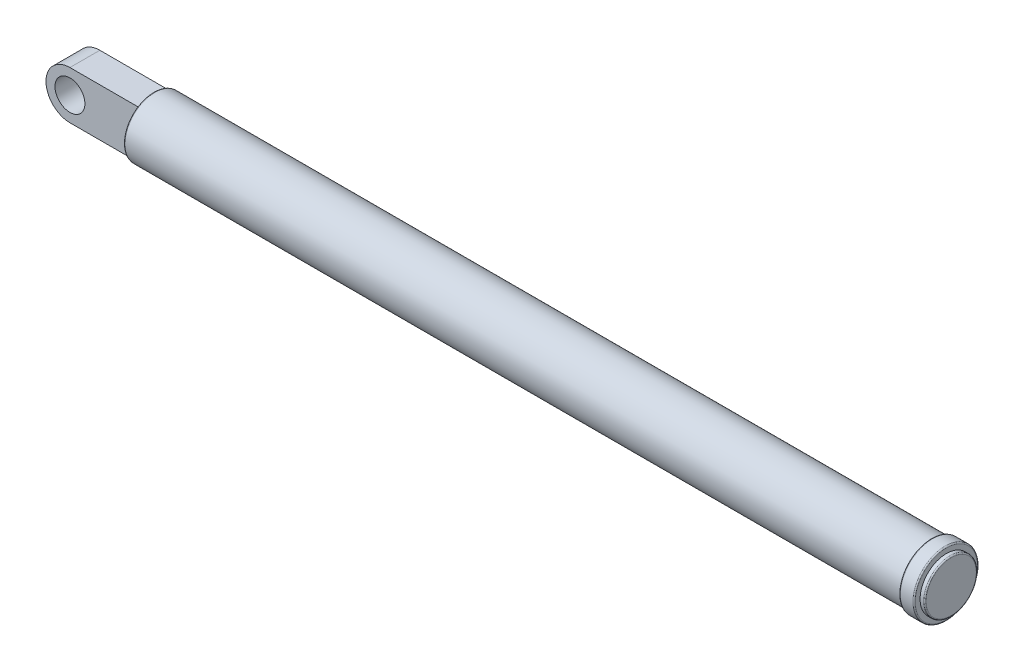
ISO-10303-21;
HEADER;
FILE_DESCRIPTION(('STEP AP214'),'2;1');
FILE_NAME('part.step','',(''),(''),'','','');
FILE_SCHEMA(('AUTOMOTIVE_DESIGN { 1 0 10303 214 1 1 1 1 }'));
ENDSEC;
DATA;
#1=APPLICATION_CONTEXT('core data for automotive mechanical design processes');
#2=APPLICATION_PROTOCOL_DEFINITION('international standard','automotive_design',2000,#1);
#3=PRODUCT_CONTEXT('',#1,'mechanical');
#4=PRODUCT('Part','Part','',(#3));
#5=PRODUCT_RELATED_PRODUCT_CATEGORY('part','',(#4));
#6=PRODUCT_DEFINITION_FORMATION('','',#4);
#7=PRODUCT_DEFINITION_CONTEXT('part definition',#1,'design');
#8=PRODUCT_DEFINITION('design','',#6,#7);
#9=PRODUCT_DEFINITION_SHAPE('','',#8);
#10=(LENGTH_UNIT() NAMED_UNIT(*) SI_UNIT(.MILLI.,.METRE.));
#11=(NAMED_UNIT(*) PLANE_ANGLE_UNIT() SI_UNIT($,.RADIAN.));
#12=(NAMED_UNIT(*) SI_UNIT($,.STERADIAN.) SOLID_ANGLE_UNIT());
#13=UNCERTAINTY_MEASURE_WITH_UNIT(LENGTH_MEASURE(1.E-05),#10,'distance_accuracy_value','');
#14=(GEOMETRIC_REPRESENTATION_CONTEXT(3) GLOBAL_UNCERTAINTY_ASSIGNED_CONTEXT((#13)) GLOBAL_UNIT_ASSIGNED_CONTEXT((#10,
#11,#12)) REPRESENTATION_CONTEXT('',''));
#15=CARTESIAN_POINT('',(0.,0.,0.));
#16=DIRECTION('',(0.,0.,1.));
#17=DIRECTION('',(1.,0.,0.));
#18=AXIS2_PLACEMENT_3D('',#15,#16,#17);
#19=CARTESIAN_POINT('',(0.,0.,0.));
#20=DIRECTION('',(1.,0.,0.));
#21=DIRECTION('',(0.,0.,-1.));
#22=AXIS2_PLACEMENT_3D('',#19,#20,#21);
#23=PLANE('',#22);
#24=CARTESIAN_POINT('',(0.,0.,0.));
#25=DIRECTION('',(1.,0.,0.));
#26=DIRECTION('',(0.,0.,-1.));
#27=AXIS2_PLACEMENT_3D('',#24,#25,#26);
#28=CIRCLE('',#27,48.);
#29=CARTESIAN_POINT('',(0.,0.,-48.));
#30=VERTEX_POINT('',#29);
#31=EDGE_CURVE('E103',#30,#30,#28,.F.);
#32=ORIENTED_EDGE('',*,*,#31,.T.);
#33=EDGE_LOOP('',(#32));
#34=FACE_BOUND('',#33,.T.);
#35=DIRECTION('',(0.,0.,1.));
#36=VECTOR('',#35,1.);
#37=CARTESIAN_POINT('',(0.,-40.,0.));
#38=LINE('',#37,#36);
#39=CARTESIAN_POINT('',(0.,-40.,-25.));
#40=VERTEX_POINT('',#39);
#41=CARTESIAN_POINT('',(0.,-40.,25.));
#42=VERTEX_POINT('',#41);
#43=EDGE_CURVE('E11',#40,#42,#38,.T.);
#44=ORIENTED_EDGE('',*,*,#43,.F.);
#45=DIRECTION('',(0.,-1.,0.));
#46=VECTOR('',#45,1.);
#47=CARTESIAN_POINT('',(0.,0.,-25.));
#48=LINE('',#47,#46);
#49=CARTESIAN_POINT('',(0.,40.,-25.));
#50=VERTEX_POINT('',#49);
#51=EDGE_CURVE('E127',#50,#40,#48,.T.);
#52=ORIENTED_EDGE('',*,*,#51,.F.);
#53=DIRECTION('',(0.,0.,-1.));
#54=VECTOR('',#53,1.);
#55=CARTESIAN_POINT('',(0.,40.,0.));
#56=LINE('',#55,#54);
#57=CARTESIAN_POINT('',(0.,40.,25.));
#58=VERTEX_POINT('',#57);
#59=EDGE_CURVE('E124',#58,#50,#56,.T.);
#60=ORIENTED_EDGE('',*,*,#59,.F.);
#61=DIRECTION('',(0.,-1.,0.));
#62=VECTOR('',#61,1.);
#63=CARTESIAN_POINT('',(0.,0.,25.));
#64=LINE('',#63,#62);
#65=EDGE_CURVE('E39',#58,#42,#64,.T.);
#66=ORIENTED_EDGE('',*,*,#65,.T.);
#67=EDGE_LOOP('',(#44,#52,#60,#66));
#68=FACE_BOUND('',#67,.T.);
#69=ADVANCED_FACE('F31',(#34,#68),#23,.F.);
#70=CARTESIAN_POINT('',(1325.,0.,0.));
#71=DIRECTION('',(1.,0.,0.));
#72=DIRECTION('',(0.,0.,-1.));
#73=AXIS2_PLACEMENT_3D('',#70,#71,#72);
#74=PLANE('',#73);
#75=CARTESIAN_POINT('',(1325.,0.,0.));
#76=DIRECTION('',(1.,0.,0.));
#77=DIRECTION('',(0.,0.,-1.));
#78=AXIS2_PLACEMENT_3D('',#75,#76,#77);
#79=CIRCLE('',#78,52.);
#80=CARTESIAN_POINT('',(1325.,0.,-52.));
#81=VERTEX_POINT('',#80);
#82=EDGE_CURVE('E112',#81,#81,#79,.T.);
#83=ORIENTED_EDGE('',*,*,#82,.T.);
#84=EDGE_LOOP('',(#83));
#85=FACE_BOUND('',#84,.T.);
#86=CARTESIAN_POINT('',(1325.,0.,0.));
#87=DIRECTION('',(1.,0.,0.));
#88=DIRECTION('',(0.,0.,-1.));
#89=AXIS2_PLACEMENT_3D('',#86,#87,#88);
#90=CIRCLE('',#89,44.);
#91=CARTESIAN_POINT('',(1325.,0.,-44.));
#92=VERTEX_POINT('',#91);
#93=EDGE_CURVE('E89',#92,#92,#90,.T.);
#94=ORIENTED_EDGE('',*,*,#93,.F.);
#95=EDGE_LOOP('',(#94));
#96=FACE_BOUND('',#95,.T.);
#97=ADVANCED_FACE('F158',(#85,#96),#74,.T.);
#98=CARTESIAN_POINT('',(1300.,0.,0.));
#99=DIRECTION('',(-1.,0.,0.));
#100=DIRECTION('',(0.,0.,1.));
#101=AXIS2_PLACEMENT_3D('',#98,#99,#100);
#102=CYLINDRICAL_SURFACE('',#101,50.);
#103=CARTESIAN_POINT('',(2.,0.,0.));
#104=DIRECTION('',(1.,0.,0.));
#105=DIRECTION('',(0.,0.,-1.));
#106=AXIS2_PLACEMENT_3D('',#103,#104,#105);
#107=CIRCLE('',#106,50.);
#108=CARTESIAN_POINT('',(2.,0.,-50.));
#109=VERTEX_POINT('',#108);
#110=EDGE_CURVE('E100',#109,#109,#107,.T.);
#111=ORIENTED_EDGE('',*,*,#110,.T.);
#112=EDGE_LOOP('',(#111));
#113=FACE_BOUND('',#112,.T.);
#114=CARTESIAN_POINT('',(1300.,0.,0.));
#115=DIRECTION('',(1.,0.,0.));
#116=DIRECTION('',(0.,0.,-1.));
#117=AXIS2_PLACEMENT_3D('',#114,#115,#116);
#118=CIRCLE('',#117,50.);
#119=CARTESIAN_POINT('',(1300.,0.,-50.));
#120=VERTEX_POINT('',#119);
#121=EDGE_CURVE('E93',#120,#120,#118,.T.);
#122=ORIENTED_EDGE('',*,*,#121,.F.);
#123=EDGE_LOOP('',(#122));
#124=FACE_BOUND('',#123,.T.);
#125=ADVANCED_FACE('F164',(#113,#124),#102,.T.);
#126=CARTESIAN_POINT('',(1300.,0.,0.));
#127=DIRECTION('',(1.,0.,0.));
#128=DIRECTION('',(0.,0.,-1.));
#129=AXIS2_PLACEMENT_3D('',#126,#127,#128);
#130=PLANE('',#129);
#131=CARTESIAN_POINT('',(1300.,0.,0.));
#132=DIRECTION('',(1.,0.,0.));
#133=DIRECTION('',(0.,0.,-1.));
#134=AXIS2_PLACEMENT_3D('',#131,#132,#133);
#135=CIRCLE('',#134,52.);
#136=CARTESIAN_POINT('',(1300.,0.,-52.));
#137=VERTEX_POINT('',#136);
#138=EDGE_CURVE('E121',#137,#137,#135,.F.);
#139=ORIENTED_EDGE('',*,*,#138,.T.);
#140=EDGE_LOOP('',(#139));
#141=FACE_BOUND('',#140,.T.);
#142=ORIENTED_EDGE('',*,*,#121,.T.);
#143=EDGE_LOOP('',(#142));
#144=FACE_BOUND('',#143,.T.);
#145=ADVANCED_FACE('F173',(#141,#144),#130,.F.);
#146=CARTESIAN_POINT('',(1325.,0.,0.));
#147=DIRECTION('',(-1.,0.,0.));
#148=DIRECTION('',(0.,0.,1.));
#149=AXIS2_PLACEMENT_3D('',#146,#147,#148);
#150=CYLINDRICAL_SURFACE('',#149,54.);
#151=CARTESIAN_POINT('',(1323.,0.,0.));
#152=DIRECTION('',(1.,0.,0.));
#153=DIRECTION('',(0.,0.,-1.));
#154=AXIS2_PLACEMENT_3D('',#151,#152,#153);
#155=CIRCLE('',#154,54.);
#156=CARTESIAN_POINT('',(1323.,0.,-54.));
#157=VERTEX_POINT('',#156);
#158=EDGE_CURVE('E118',#157,#157,#155,.F.);
#159=ORIENTED_EDGE('',*,*,#158,.T.);
#160=EDGE_LOOP('',(#159));
#161=FACE_BOUND('',#160,.T.);
#162=CARTESIAN_POINT('',(1302.,0.,0.));
#163=DIRECTION('',(1.,0.,0.));
#164=DIRECTION('',(0.,0.,-1.));
#165=AXIS2_PLACEMENT_3D('',#162,#163,#164);
#166=CIRCLE('',#165,54.);
#167=CARTESIAN_POINT('',(1302.,0.,-54.));
#168=VERTEX_POINT('',#167);
#169=EDGE_CURVE('E115',#168,#168,#166,.T.);
#170=ORIENTED_EDGE('',*,*,#169,.T.);
#171=EDGE_LOOP('',(#170));
#172=FACE_BOUND('',#171,.T.);
#173=ADVANCED_FACE('F169',(#161,#172),#150,.T.);
#174=CARTESIAN_POINT('',(1333.,0.,0.));
#175=DIRECTION('',(-1.,0.,0.));
#176=DIRECTION('',(0.,0.,1.));
#177=AXIS2_PLACEMENT_3D('',#174,#175,#176);
#178=CYLINDRICAL_SURFACE('',#177,44.);
#179=CARTESIAN_POINT('',(1331.,0.,0.));
#180=DIRECTION('',(1.,0.,0.));
#181=DIRECTION('',(0.,0.,-1.));
#182=AXIS2_PLACEMENT_3D('',#179,#180,#181);
#183=CIRCLE('',#182,44.);
#184=CARTESIAN_POINT('',(1331.,0.,-44.));
#185=VERTEX_POINT('',#184);
#186=EDGE_CURVE('E109',#185,#185,#183,.F.);
#187=ORIENTED_EDGE('',*,*,#186,.T.);
#188=EDGE_LOOP('',(#187));
#189=FACE_BOUND('',#188,.T.);
#190=ORIENTED_EDGE('',*,*,#93,.T.);
#191=EDGE_LOOP('',(#190));
#192=FACE_BOUND('',#191,.T.);
#193=ADVANCED_FACE('F193',(#189,#192),#178,.T.);
#194=CARTESIAN_POINT('',(1333.,0.,0.));
#195=DIRECTION('',(1.,0.,0.));
#196=DIRECTION('',(0.,0.,-1.));
#197=AXIS2_PLACEMENT_3D('',#194,#195,#196);
#198=PLANE('',#197);
#199=CARTESIAN_POINT('',(1333.,0.,0.));
#200=DIRECTION('',(1.,0.,0.));
#201=DIRECTION('',(0.,0.,-1.));
#202=AXIS2_PLACEMENT_3D('',#199,#200,#201);
#203=CIRCLE('',#202,42.);
#204=CARTESIAN_POINT('',(1333.,0.,-42.));
#205=VERTEX_POINT('',#204);
#206=EDGE_CURVE('E106',#205,#205,#203,.T.);
#207=ORIENTED_EDGE('',*,*,#206,.T.);
#208=EDGE_LOOP('',(#207));
#209=FACE_BOUND('',#208,.T.);
#210=ADVANCED_FACE('F179',(#209),#198,.T.);
#211=CARTESIAN_POINT('',(2.,0.,0.));
#212=DIRECTION('',(1.,0.,0.));
#213=DIRECTION('',(0.,0.,-1.));
#214=AXIS2_PLACEMENT_3D('',#211,#212,#213);
#215=TOROIDAL_SURFACE('',#214,48.,2.);
#216=ORIENTED_EDGE('',*,*,#31,.F.);
#217=EDGE_LOOP('',(#216));
#218=FACE_BOUND('',#217,.T.);
#219=ORIENTED_EDGE('',*,*,#110,.F.);
#220=EDGE_LOOP('',(#219));
#221=FACE_BOUND('',#220,.T.);
#222=ADVANCED_FACE('F175',(#218,#221),#215,.T.);
#223=CARTESIAN_POINT('',(1331.,0.,0.));
#224=DIRECTION('',(1.,0.,0.));
#225=DIRECTION('',(0.,0.,-1.));
#226=AXIS2_PLACEMENT_3D('',#223,#224,#225);
#227=TOROIDAL_SURFACE('',#226,42.,2.);
#228=ORIENTED_EDGE('',*,*,#186,.F.);
#229=EDGE_LOOP('',(#228));
#230=FACE_BOUND('',#229,.T.);
#231=ORIENTED_EDGE('',*,*,#206,.F.);
#232=EDGE_LOOP('',(#231));
#233=FACE_BOUND('',#232,.T.);
#234=ADVANCED_FACE('F178',(#230,#233),#227,.T.);
#235=CARTESIAN_POINT('',(1323.,0.,0.));
#236=DIRECTION('',(1.,0.,0.));
#237=DIRECTION('',(0.,0.,-1.));
#238=AXIS2_PLACEMENT_3D('',#235,#236,#237);
#239=TOROIDAL_SURFACE('',#238,52.,2.);
#240=ORIENTED_EDGE('',*,*,#158,.F.);
#241=EDGE_LOOP('',(#240));
#242=FACE_BOUND('',#241,.T.);
#243=ORIENTED_EDGE('',*,*,#82,.F.);
#244=EDGE_LOOP('',(#243));
#245=FACE_BOUND('',#244,.T.);
#246=ADVANCED_FACE('F154',(#242,#245),#239,.T.);
#247=CARTESIAN_POINT('',(1302.,0.,0.));
#248=DIRECTION('',(1.,0.,0.));
#249=DIRECTION('',(0.,0.,-1.));
#250=AXIS2_PLACEMENT_3D('',#247,#248,#249);
#251=TOROIDAL_SURFACE('',#250,52.,2.);
#252=ORIENTED_EDGE('',*,*,#138,.F.);
#253=EDGE_LOOP('',(#252));
#254=FACE_BOUND('',#253,.T.);
#255=ORIENTED_EDGE('',*,*,#169,.F.);
#256=EDGE_LOOP('',(#255));
#257=FACE_BOUND('',#256,.T.);
#258=ADVANCED_FACE('F33',(#254,#257),#251,.T.);
#259=CARTESIAN_POINT('',(-115.,0.,25.));
#260=DIRECTION('',(0.,0.,1.));
#261=DIRECTION('',(1.,0.,0.));
#262=AXIS2_PLACEMENT_3D('',#259,#260,#261);
#263=PLANE('',#262);
#264=CARTESIAN_POINT('',(-115.,0.,25.));
#265=DIRECTION('',(0.,0.,1.));
#266=DIRECTION('',(1.,0.,0.));
#267=AXIS2_PLACEMENT_3D('',#264,#265,#266);
#268=CIRCLE('',#267,25.);
#269=CARTESIAN_POINT('',(-90.,0.,25.));
#270=VERTEX_POINT('',#269);
#271=EDGE_CURVE('E133',#270,#270,#268,.T.);
#272=ORIENTED_EDGE('',*,*,#271,.F.);
#273=EDGE_LOOP('',(#272));
#274=FACE_BOUND('',#273,.T.);
#275=ORIENTED_EDGE('',*,*,#65,.F.);
#276=DIRECTION('',(-1.,0.,0.));
#277=VECTOR('',#276,1.);
#278=CARTESIAN_POINT('',(-115.,40.,25.));
#279=LINE('',#278,#277);
#280=CARTESIAN_POINT('',(-115.,40.,25.));
#281=VERTEX_POINT('',#280);
#282=EDGE_CURVE('E75',#58,#281,#279,.T.);
#283=ORIENTED_EDGE('',*,*,#282,.T.);
#284=CARTESIAN_POINT('',(-115.,0.,25.));
#285=DIRECTION('',(0.,0.,1.));
#286=DIRECTION('',(1.,0.,0.));
#287=AXIS2_PLACEMENT_3D('',#284,#285,#286);
#288=CIRCLE('',#287,40.);
#289=CARTESIAN_POINT('',(-115.,-40.,25.));
#290=VERTEX_POINT('',#289);
#291=EDGE_CURVE('E76',#281,#290,#288,.T.);
#292=ORIENTED_EDGE('',*,*,#291,.T.);
#293=DIRECTION('',(1.,0.,0.));
#294=VECTOR('',#293,1.);
#295=CARTESIAN_POINT('',(-115.,-40.,25.));
#296=LINE('',#295,#294);
#297=EDGE_CURVE('E67',#290,#42,#296,.T.);
#298=ORIENTED_EDGE('',*,*,#297,.T.);
#299=EDGE_LOOP('',(#275,#283,#292,#298));
#300=FACE_BOUND('',#299,.T.);
#301=ADVANCED_FACE('F79',(#274,#300),#263,.T.);
#302=CARTESIAN_POINT('',(-115.,0.,-25.));
#303=DIRECTION('',(0.,0.,1.));
#304=DIRECTION('',(1.,0.,0.));
#305=AXIS2_PLACEMENT_3D('',#302,#303,#304);
#306=PLANE('',#305);
#307=CARTESIAN_POINT('',(-115.,0.,-25.));
#308=DIRECTION('',(0.,0.,1.));
#309=DIRECTION('',(1.,0.,0.));
#310=AXIS2_PLACEMENT_3D('',#307,#308,#309);
#311=CIRCLE('',#310,25.);
#312=CARTESIAN_POINT('',(-90.,0.,-25.));
#313=VERTEX_POINT('',#312);
#314=EDGE_CURVE('E137',#313,#313,#311,.T.);
#315=ORIENTED_EDGE('',*,*,#314,.T.);
#316=EDGE_LOOP('',(#315));
#317=FACE_BOUND('',#316,.T.);
#318=DIRECTION('',(-1.,0.,0.));
#319=VECTOR('',#318,1.);
#320=CARTESIAN_POINT('',(-115.,40.,-25.));
#321=LINE('',#320,#319);
#322=CARTESIAN_POINT('',(-115.,40.,-25.));
#323=VERTEX_POINT('',#322);
#324=EDGE_CURVE('E84',#50,#323,#321,.T.);
#325=ORIENTED_EDGE('',*,*,#324,.F.);
#326=ORIENTED_EDGE('',*,*,#51,.T.);
#327=DIRECTION('',(1.,0.,0.));
#328=VECTOR('',#327,1.);
#329=CARTESIAN_POINT('',(-115.,-40.,-25.));
#330=LINE('',#329,#328);
#331=CARTESIAN_POINT('',(-115.,-40.,-25.));
#332=VERTEX_POINT('',#331);
#333=EDGE_CURVE('E131',#332,#40,#330,.T.);
#334=ORIENTED_EDGE('',*,*,#333,.F.);
#335=CARTESIAN_POINT('',(-115.,0.,-25.));
#336=DIRECTION('',(0.,0.,1.));
#337=DIRECTION('',(1.,0.,0.));
#338=AXIS2_PLACEMENT_3D('',#335,#336,#337);
#339=CIRCLE('',#338,40.);
#340=EDGE_CURVE('E88',#323,#332,#339,.T.);
#341=ORIENTED_EDGE('',*,*,#340,.F.);
#342=EDGE_LOOP('',(#325,#326,#334,#341));
#343=FACE_BOUND('',#342,.T.);
#344=ADVANCED_FACE('F130',(#317,#343),#306,.F.);
#345=CARTESIAN_POINT('',(-115.,-40.,25.));
#346=DIRECTION('',(0.,1.,0.));
#347=DIRECTION('',(-1.,0.,0.));
#348=AXIS2_PLACEMENT_3D('',#345,#346,#347);
#349=PLANE('',#348);
#350=ORIENTED_EDGE('',*,*,#333,.T.);
#351=ORIENTED_EDGE('',*,*,#43,.T.);
#352=ORIENTED_EDGE('',*,*,#297,.F.);
#353=DIRECTION('',(0.,0.,-1.));
#354=VECTOR('',#353,1.);
#355=CARTESIAN_POINT('',(-115.,-40.,25.));
#356=LINE('',#355,#354);
#357=EDGE_CURVE('E72',#290,#332,#356,.T.);
#358=ORIENTED_EDGE('',*,*,#357,.T.);
#359=EDGE_LOOP('',(#350,#351,#352,#358));
#360=FACE_BOUND('',#359,.T.);
#361=ADVANCED_FACE('F70',(#360),#349,.F.);
#362=CARTESIAN_POINT('',(-115.,40.,25.));
#363=DIRECTION('',(0.,-1.,0.));
#364=DIRECTION('',(0.,0.,-1.));
#365=AXIS2_PLACEMENT_3D('',#362,#363,#364);
#366=PLANE('',#365);
#367=ORIENTED_EDGE('',*,*,#282,.F.);
#368=ORIENTED_EDGE('',*,*,#59,.T.);
#369=ORIENTED_EDGE('',*,*,#324,.T.);
#370=DIRECTION('',(0.,0.,-1.));
#371=VECTOR('',#370,1.);
#372=CARTESIAN_POINT('',(-115.,40.,25.));
#373=LINE('',#372,#371);
#374=EDGE_CURVE('E90',#281,#323,#373,.T.);
#375=ORIENTED_EDGE('',*,*,#374,.F.);
#376=EDGE_LOOP('',(#367,#368,#369,#375));
#377=FACE_BOUND('',#376,.T.);
#378=ADVANCED_FACE('F278',(#377),#366,.F.);
#379=CARTESIAN_POINT('',(-115.,0.,25.));
#380=DIRECTION('',(0.,0.,-1.));
#381=DIRECTION('',(-1.,0.,0.));
#382=AXIS2_PLACEMENT_3D('',#379,#380,#381);
#383=CYLINDRICAL_SURFACE('',#382,40.);
#384=ORIENTED_EDGE('',*,*,#340,.T.);
#385=ORIENTED_EDGE('',*,*,#357,.F.);
#386=ORIENTED_EDGE('',*,*,#291,.F.);
#387=ORIENTED_EDGE('',*,*,#374,.T.);
#388=EDGE_LOOP('',(#384,#385,#386,#387));
#389=FACE_BOUND('',#388,.T.);
#390=ADVANCED_FACE('F86',(#389),#383,.T.);
#391=CARTESIAN_POINT('',(-115.,0.,25.));
#392=DIRECTION('',(0.,0.,-1.));
#393=DIRECTION('',(-1.,0.,0.));
#394=AXIS2_PLACEMENT_3D('',#391,#392,#393);
#395=CYLINDRICAL_SURFACE('',#394,25.);
#396=ORIENTED_EDGE('',*,*,#271,.T.);
#397=EDGE_LOOP('',(#396));
#398=FACE_BOUND('',#397,.T.);
#399=ORIENTED_EDGE('',*,*,#314,.F.);
#400=EDGE_LOOP('',(#399));
#401=FACE_BOUND('',#400,.T.);
#402=ADVANCED_FACE('F143',(#398,#401),#395,.F.);
#403=CLOSED_SHELL('',(#69,#97,#125,#145,#173,#193,#210,#222,#234,#246,#258,#301,#344,#361,#378,
#390,#402));
#404=MANIFOLD_SOLID_BREP('B2',#403);
#405=ADVANCED_BREP_SHAPE_REPRESENTATION('',(#18,#404),#14);
#406=SHAPE_DEFINITION_REPRESENTATION(#9,#405);
ENDSEC;
END-ISO-10303-21;
